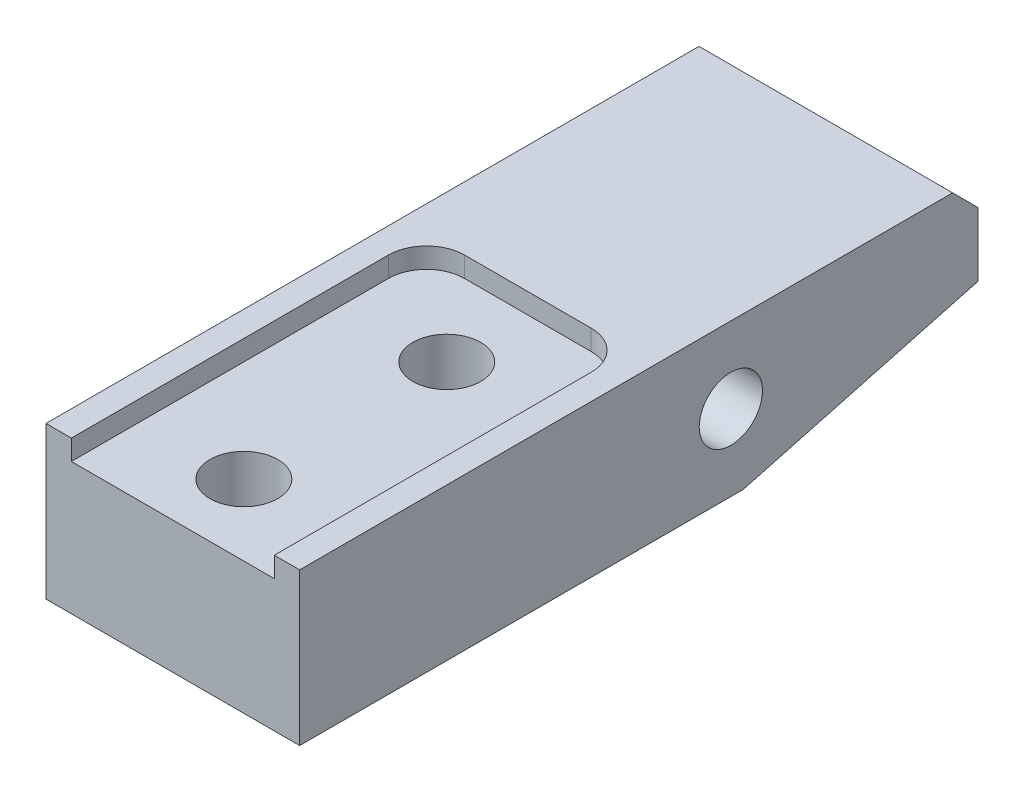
ISO-10303-21;
HEADER;
FILE_DESCRIPTION(('STEP AP214'),'2;1');
FILE_NAME('part.step','',(''),(''),'','','');
FILE_SCHEMA(('AUTOMOTIVE_DESIGN { 1 0 10303 214 1 1 1 1 }'));
ENDSEC;
DATA;
#1=APPLICATION_CONTEXT('core data for automotive mechanical design processes');
#2=APPLICATION_PROTOCOL_DEFINITION('international standard','automotive_design',2000,#1);
#3=PRODUCT_CONTEXT('',#1,'mechanical');
#4=PRODUCT('Part','Part','',(#3));
#5=PRODUCT_RELATED_PRODUCT_CATEGORY('part','',(#4));
#6=PRODUCT_DEFINITION_FORMATION('','',#4);
#7=PRODUCT_DEFINITION_CONTEXT('part definition',#1,'design');
#8=PRODUCT_DEFINITION('design','',#6,#7);
#9=PRODUCT_DEFINITION_SHAPE('','',#8);
#10=(LENGTH_UNIT() NAMED_UNIT(*) SI_UNIT(.MILLI.,.METRE.));
#11=(NAMED_UNIT(*) PLANE_ANGLE_UNIT() SI_UNIT($,.RADIAN.));
#12=(NAMED_UNIT(*) SI_UNIT($,.STERADIAN.) SOLID_ANGLE_UNIT());
#13=UNCERTAINTY_MEASURE_WITH_UNIT(LENGTH_MEASURE(1.E-05),#10,'distance_accuracy_value','');
#14=(GEOMETRIC_REPRESENTATION_CONTEXT(3) GLOBAL_UNCERTAINTY_ASSIGNED_CONTEXT((#13)) GLOBAL_UNIT_ASSIGNED_CONTEXT((#10,
#11,#12)) REPRESENTATION_CONTEXT('',''));
#15=CARTESIAN_POINT('',(0.,0.,0.));
#16=DIRECTION('',(0.,0.,1.));
#17=DIRECTION('',(1.,0.,0.));
#18=AXIS2_PLACEMENT_3D('',#15,#16,#17);
#19=CARTESIAN_POINT('',(-15.875,9.525,-42.4561));
#20=DIRECTION('',(1.,0.,0.));
#21=DIRECTION('',(0.,0.,-1.));
#22=AXIS2_PLACEMENT_3D('',#19,#20,#21);
#23=PLANE('',#22);
#24=CARTESIAN_POINT('',(-15.875,0.,-11.5189));
#25=DIRECTION('',(-1.,0.,0.));
#26=DIRECTION('',(0.,0.,1.));
#27=AXIS2_PLACEMENT_3D('',#24,#25,#26);
#28=CIRCLE('',#27,3.9624);
#29=CARTESIAN_POINT('',(-15.875,0.,-7.5565));
#30=VERTEX_POINT('',#29);
#31=EDGE_CURVE('E137',#30,#30,#28,.T.);
#32=ORIENTED_EDGE('',*,*,#31,.F.);
#33=EDGE_LOOP('',(#32));
#34=FACE_BOUND('',#33,.T.);
#35=DIRECTION('',(0.,0.,1.));
#36=VECTOR('',#35,1.);
#37=CARTESIAN_POINT('',(-15.875,9.525,-42.4561));
#38=LINE('',#37,#36);
#39=CARTESIAN_POINT('',(-15.875,9.525,-39.2811));
#40=VERTEX_POINT('',#39);
#41=CARTESIAN_POINT('',(-15.875,9.525,42.4561));
#42=VERTEX_POINT('',#41);
#43=EDGE_CURVE('E191',#40,#42,#38,.T.);
#44=ORIENTED_EDGE('',*,*,#43,.F.);
#45=DIRECTION('',(0.,-0.707106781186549,-0.707106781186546));
#46=VECTOR('',#45,1.);
#47=CARTESIAN_POINT('',(-15.875,9.525,-39.2811));
#48=LINE('',#47,#46);
#49=CARTESIAN_POINT('',(-15.875,6.34999999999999,-42.4561));
#50=VERTEX_POINT('',#49);
#51=EDGE_CURVE('E57',#40,#50,#48,.T.);
#52=ORIENTED_EDGE('',*,*,#51,.T.);
#53=DIRECTION('',(0.,-1.,0.));
#54=VECTOR('',#53,1.);
#55=CARTESIAN_POINT('',(-15.875,9.525,-42.4561));
#56=LINE('',#55,#54);
#57=CARTESIAN_POINT('',(-15.875,-1.651,-42.4561));
#58=VERTEX_POINT('',#57);
#59=EDGE_CURVE('E128',#50,#58,#56,.T.);
#60=ORIENTED_EDGE('',*,*,#59,.T.);
#61=DIRECTION('',(0.,0.258819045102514,-0.96592582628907));
#62=VECTOR('',#61,1.);
#63=CARTESIAN_POINT('',(-15.875,-9.525,-13.0699319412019));
#64=LINE('',#63,#62);
#65=CARTESIAN_POINT('',(-15.875,-9.525,-13.0699319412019));
#66=VERTEX_POINT('',#65);
#67=EDGE_CURVE('E136',#66,#58,#64,.T.);
#68=ORIENTED_EDGE('',*,*,#67,.F.);
#69=DIRECTION('',(0.,0.,1.));
#70=VECTOR('',#69,1.);
#71=CARTESIAN_POINT('',(-15.875,-9.525,-42.4561));
#72=LINE('',#71,#70);
#73=CARTESIAN_POINT('',(-15.875,-9.525,42.4561));
#74=VERTEX_POINT('',#73);
#75=EDGE_CURVE('E188',#66,#74,#72,.T.);
#76=ORIENTED_EDGE('',*,*,#75,.T.);
#77=DIRECTION('',(0.,-1.,0.));
#78=VECTOR('',#77,1.);
#79=CARTESIAN_POINT('',(-15.875,9.525,42.4561));
#80=LINE('',#79,#78);
#81=EDGE_CURVE('E206',#42,#74,#80,.T.);
#82=ORIENTED_EDGE('',*,*,#81,.F.);
#83=EDGE_LOOP('',(#44,#52,#60,#68,#76,#82));
#84=FACE_BOUND('',#83,.T.);
#85=ADVANCED_FACE('F35',(#34,#84),#23,.F.);
#86=CARTESIAN_POINT('',(-15.875,9.525,42.4561));
#87=DIRECTION('',(0.,0.,-1.));
#88=DIRECTION('',(-1.,0.,0.));
#89=AXIS2_PLACEMENT_3D('',#86,#87,#88);
#90=PLANE('',#89);
#91=DIRECTION('',(1.,0.,0.));
#92=VECTOR('',#91,1.);
#93=CARTESIAN_POINT('',(-15.875,9.525,42.4561));
#94=LINE('',#93,#92);
#95=CARTESIAN_POINT('',(12.7,9.525,42.4561));
#96=VERTEX_POINT('',#95);
#97=CARTESIAN_POINT('',(15.875,9.525,42.4561));
#98=VERTEX_POINT('',#97);
#99=EDGE_CURVE('E193',#96,#98,#94,.T.);
#100=ORIENTED_EDGE('',*,*,#99,.F.);
#101=DIRECTION('',(0.,1.,0.));
#102=VECTOR('',#101,1.);
#103=CARTESIAN_POINT('',(12.7,6.985,42.4561));
#104=LINE('',#103,#102);
#105=CARTESIAN_POINT('',(12.7,6.985,42.4561));
#106=VERTEX_POINT('',#105);
#107=EDGE_CURVE('E186',#106,#96,#104,.T.);
#108=ORIENTED_EDGE('',*,*,#107,.F.);
#109=DIRECTION('',(1.,0.,0.));
#110=VECTOR('',#109,1.);
#111=CARTESIAN_POINT('',(12.7,6.985,42.4561));
#112=LINE('',#111,#110);
#113=CARTESIAN_POINT('',(-12.7,6.985,42.4561));
#114=VERTEX_POINT('',#113);
#115=EDGE_CURVE('E176',#114,#106,#112,.T.);
#116=ORIENTED_EDGE('',*,*,#115,.F.);
#117=DIRECTION('',(0.,1.,0.));
#118=VECTOR('',#117,1.);
#119=CARTESIAN_POINT('',(-12.7,6.985,42.4561));
#120=LINE('',#119,#118);
#121=CARTESIAN_POINT('',(-12.7,9.525,42.4561));
#122=VERTEX_POINT('',#121);
#123=EDGE_CURVE('E179',#114,#122,#120,.T.);
#124=ORIENTED_EDGE('',*,*,#123,.T.);
#125=EDGE_CURVE('E194',#42,#122,#94,.T.);
#126=ORIENTED_EDGE('',*,*,#125,.F.);
#127=ORIENTED_EDGE('',*,*,#81,.T.);
#128=DIRECTION('',(1.,0.,0.));
#129=VECTOR('',#128,1.);
#130=CARTESIAN_POINT('',(-15.875,-9.525,42.4561));
#131=LINE('',#130,#129);
#132=CARTESIAN_POINT('',(15.875,-9.525,42.4561));
#133=VERTEX_POINT('',#132);
#134=EDGE_CURVE('E201',#74,#133,#131,.T.);
#135=ORIENTED_EDGE('',*,*,#134,.T.);
#136=DIRECTION('',(0.,-1.,0.));
#137=VECTOR('',#136,1.);
#138=CARTESIAN_POINT('',(15.875,9.525,42.4561));
#139=LINE('',#138,#137);
#140=EDGE_CURVE('E127',#98,#133,#139,.T.);
#141=ORIENTED_EDGE('',*,*,#140,.F.);
#142=EDGE_LOOP('',(#100,#108,#116,#124,#126,#127,#135,#141));
#143=FACE_BOUND('',#142,.T.);
#144=ADVANCED_FACE('F241',(#143),#90,.F.);
#145=CARTESIAN_POINT('',(15.875,9.525,-42.4561));
#146=DIRECTION('',(-1.,0.,0.));
#147=DIRECTION('',(0.,0.,1.));
#148=AXIS2_PLACEMENT_3D('',#145,#146,#147);
#149=PLANE('',#148);
#150=CARTESIAN_POINT('',(15.875,0.,-11.5189));
#151=DIRECTION('',(-1.,0.,0.));
#152=DIRECTION('',(0.,0.,1.));
#153=AXIS2_PLACEMENT_3D('',#150,#151,#152);
#154=CIRCLE('',#153,3.9624);
#155=CARTESIAN_POINT('',(15.875,0.,-7.5565));
#156=VERTEX_POINT('',#155);
#157=EDGE_CURVE('E149',#156,#156,#154,.T.);
#158=ORIENTED_EDGE('',*,*,#157,.T.);
#159=EDGE_LOOP('',(#158));
#160=FACE_BOUND('',#159,.T.);
#161=DIRECTION('',(0.,-1.,0.));
#162=VECTOR('',#161,1.);
#163=CARTESIAN_POINT('',(15.875,9.525,-42.4561));
#164=LINE('',#163,#162);
#165=CARTESIAN_POINT('',(15.875,6.34999999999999,-42.4561));
#166=VERTEX_POINT('',#165);
#167=CARTESIAN_POINT('',(15.875,-1.651,-42.4561));
#168=VERTEX_POINT('',#167);
#169=EDGE_CURVE('E120',#166,#168,#164,.T.);
#170=ORIENTED_EDGE('',*,*,#169,.F.);
#171=DIRECTION('',(0.,0.707106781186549,0.707106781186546));
#172=VECTOR('',#171,1.);
#173=CARTESIAN_POINT('',(15.875,9.525,-39.2811));
#174=LINE('',#173,#172);
#175=CARTESIAN_POINT('',(15.875,9.525,-39.2811));
#176=VERTEX_POINT('',#175);
#177=EDGE_CURVE('E11',#166,#176,#174,.T.);
#178=ORIENTED_EDGE('',*,*,#177,.T.);
#179=DIRECTION('',(0.,0.,-1.));
#180=VECTOR('',#179,1.);
#181=CARTESIAN_POINT('',(15.875,9.525,-42.4561));
#182=LINE('',#181,#180);
#183=EDGE_CURVE('E197',#98,#176,#182,.T.);
#184=ORIENTED_EDGE('',*,*,#183,.F.);
#185=ORIENTED_EDGE('',*,*,#140,.T.);
#186=DIRECTION('',(0.,0.,-1.));
#187=VECTOR('',#186,1.);
#188=CARTESIAN_POINT('',(15.875,-9.525,-42.4561));
#189=LINE('',#188,#187);
#190=CARTESIAN_POINT('',(15.875,-9.525,-13.0699319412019));
#191=VERTEX_POINT('',#190);
#192=EDGE_CURVE('E144',#133,#191,#189,.T.);
#193=ORIENTED_EDGE('',*,*,#192,.T.);
#194=DIRECTION('',(0.,0.258819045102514,-0.96592582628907));
#195=VECTOR('',#194,1.);
#196=CARTESIAN_POINT('',(15.875,-9.525,-13.0699319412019));
#197=LINE('',#196,#195);
#198=EDGE_CURVE('E133',#191,#168,#197,.T.);
#199=ORIENTED_EDGE('',*,*,#198,.T.);
#200=EDGE_LOOP('',(#170,#178,#184,#185,#193,#199));
#201=FACE_BOUND('',#200,.T.);
#202=ADVANCED_FACE('F141',(#160,#201),#149,.F.);
#203=CARTESIAN_POINT('',(-15.875,9.525,-42.4561));
#204=DIRECTION('',(0.,0.,1.));
#205=DIRECTION('',(1.,0.,0.));
#206=AXIS2_PLACEMENT_3D('',#203,#204,#205);
#207=PLANE('',#206);
#208=ORIENTED_EDGE('',*,*,#59,.F.);
#209=DIRECTION('',(1.,0.,0.));
#210=VECTOR('',#209,1.);
#211=CARTESIAN_POINT('',(15.875,6.34999999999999,-42.4561));
#212=LINE('',#211,#210);
#213=EDGE_CURVE('E43',#50,#166,#212,.T.);
#214=ORIENTED_EDGE('',*,*,#213,.T.);
#215=ORIENTED_EDGE('',*,*,#169,.T.);
#216=DIRECTION('',(-1.,0.,0.));
#217=VECTOR('',#216,1.);
#218=CARTESIAN_POINT('',(15.875,-1.651,-42.4561));
#219=LINE('',#218,#217);
#220=EDGE_CURVE('E123',#168,#58,#219,.T.);
#221=ORIENTED_EDGE('',*,*,#220,.T.);
#222=EDGE_LOOP('',(#208,#214,#215,#221));
#223=FACE_BOUND('',#222,.T.);
#224=ADVANCED_FACE('F122',(#223),#207,.F.);
#225=CARTESIAN_POINT('',(-15.875,9.525,42.4561));
#226=DIRECTION('',(0.,1.,0.));
#227=DIRECTION('',(0.,0.,1.));
#228=AXIS2_PLACEMENT_3D('',#225,#226,#227);
#229=PLANE('',#228);
#230=ORIENTED_EDGE('',*,*,#183,.T.);
#231=DIRECTION('',(-1.,0.,0.));
#232=VECTOR('',#231,1.);
#233=CARTESIAN_POINT('',(-15.875,9.525,-39.2811));
#234=LINE('',#233,#232);
#235=EDGE_CURVE('E227',#176,#40,#234,.T.);
#236=ORIENTED_EDGE('',*,*,#235,.T.);
#237=ORIENTED_EDGE('',*,*,#43,.T.);
#238=ORIENTED_EDGE('',*,*,#125,.T.);
#239=DIRECTION('',(0.,0.,1.));
#240=VECTOR('',#239,1.);
#241=CARTESIAN_POINT('',(-12.7,9.525,42.4561));
#242=LINE('',#241,#240);
#243=CARTESIAN_POINT('',(-12.7,9.525,2.7813));
#244=VERTEX_POINT('',#243);
#245=EDGE_CURVE('E171',#244,#122,#242,.T.);
#246=ORIENTED_EDGE('',*,*,#245,.F.);
#247=CARTESIAN_POINT('',(-7.9248,9.525,2.7813));
#248=DIRECTION('',(0.,1.,0.));
#249=DIRECTION('',(0.,0.,1.));
#250=AXIS2_PLACEMENT_3D('',#247,#248,#249);
#251=CIRCLE('',#250,4.7752);
#252=CARTESIAN_POINT('',(-7.9248,9.525,-1.9939));
#253=VERTEX_POINT('',#252);
#254=EDGE_CURVE('E225',#244,#253,#251,.F.);
#255=ORIENTED_EDGE('',*,*,#254,.T.);
#256=DIRECTION('',(-1.,0.,0.));
#257=VECTOR('',#256,1.);
#258=CARTESIAN_POINT('',(12.7,9.525,-1.9939));
#259=LINE('',#258,#257);
#260=CARTESIAN_POINT('',(7.9248,9.525,-1.9939));
#261=VERTEX_POINT('',#260);
#262=EDGE_CURVE('E182',#261,#253,#259,.T.);
#263=ORIENTED_EDGE('',*,*,#262,.F.);
#264=CARTESIAN_POINT('',(7.9248,9.525,2.7813));
#265=DIRECTION('',(0.,1.,0.));
#266=DIRECTION('',(0.,0.,1.));
#267=AXIS2_PLACEMENT_3D('',#264,#265,#266);
#268=CIRCLE('',#267,4.7752);
#269=CARTESIAN_POINT('',(12.7,9.525,2.7813));
#270=VERTEX_POINT('',#269);
#271=EDGE_CURVE('E223',#261,#270,#268,.F.);
#272=ORIENTED_EDGE('',*,*,#271,.T.);
#273=DIRECTION('',(0.,0.,-1.));
#274=VECTOR('',#273,1.);
#275=CARTESIAN_POINT('',(12.7,9.525,42.4561));
#276=LINE('',#275,#274);
#277=EDGE_CURVE('E166',#96,#270,#276,.T.);
#278=ORIENTED_EDGE('',*,*,#277,.F.);
#279=ORIENTED_EDGE('',*,*,#99,.T.);
#280=EDGE_LOOP('',(#230,#236,#237,#238,#246,#255,#263,#272,#278,#279));
#281=FACE_BOUND('',#280,.T.);
#282=ADVANCED_FACE('F232',(#281),#229,.T.);
#283=CARTESIAN_POINT('',(-15.875,-9.525,42.4561));
#284=DIRECTION('',(0.,1.,0.));
#285=DIRECTION('',(0.,0.,1.));
#286=AXIS2_PLACEMENT_3D('',#283,#284,#285);
#287=PLANE('',#286);
#288=CARTESIAN_POINT('',(0.,-9.525,8.1661));
#289=DIRECTION('',(0.,1.,0.));
#290=DIRECTION('',(0.,0.,1.));
#291=AXIS2_PLACEMENT_3D('',#288,#289,#290);
#292=CIRCLE('',#291,4.25);
#293=CARTESIAN_POINT('',(0.,-9.525,12.4161));
#294=VERTEX_POINT('',#293);
#295=EDGE_CURVE('E152',#294,#294,#292,.T.);
#296=ORIENTED_EDGE('',*,*,#295,.T.);
#297=EDGE_LOOP('',(#296));
#298=FACE_BOUND('',#297,.T.);
#299=CARTESIAN_POINT('',(0.,-9.525,33.5661));
#300=DIRECTION('',(0.,1.,0.));
#301=DIRECTION('',(0.,0.,1.));
#302=AXIS2_PLACEMENT_3D('',#299,#300,#301);
#303=CIRCLE('',#302,4.25);
#304=CARTESIAN_POINT('',(0.,-9.525,37.8161));
#305=VERTEX_POINT('',#304);
#306=EDGE_CURVE('E160',#305,#305,#303,.T.);
#307=ORIENTED_EDGE('',*,*,#306,.T.);
#308=EDGE_LOOP('',(#307));
#309=FACE_BOUND('',#308,.T.);
#310=ORIENTED_EDGE('',*,*,#75,.F.);
#311=DIRECTION('',(-1.,0.,0.));
#312=VECTOR('',#311,1.);
#313=CARTESIAN_POINT('',(15.875,-9.525,-13.0699319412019));
#314=LINE('',#313,#312);
#315=EDGE_CURVE('E138',#191,#66,#314,.T.);
#316=ORIENTED_EDGE('',*,*,#315,.F.);
#317=ORIENTED_EDGE('',*,*,#192,.F.);
#318=ORIENTED_EDGE('',*,*,#134,.F.);
#319=EDGE_LOOP('',(#310,#316,#317,#318));
#320=FACE_BOUND('',#319,.T.);
#321=ADVANCED_FACE('F312',(#298,#309,#320),#287,.F.);
#322=CARTESIAN_POINT('',(12.7,6.985,42.4561));
#323=DIRECTION('',(1.,0.,0.));
#324=DIRECTION('',(0.,0.,-1.));
#325=AXIS2_PLACEMENT_3D('',#322,#323,#324);
#326=PLANE('',#325);
#327=ORIENTED_EDGE('',*,*,#277,.T.);
#328=DIRECTION('',(0.,1.,0.));
#329=VECTOR('',#328,1.);
#330=CARTESIAN_POINT('',(12.7,6.985,2.7813));
#331=LINE('',#330,#329);
#332=CARTESIAN_POINT('',(12.7,6.985,2.7813));
#333=VERTEX_POINT('',#332);
#334=EDGE_CURVE('E214',#270,#333,#331,.F.);
#335=ORIENTED_EDGE('',*,*,#334,.T.);
#336=DIRECTION('',(0.,0.,-1.));
#337=VECTOR('',#336,1.);
#338=CARTESIAN_POINT('',(12.7,6.985,42.4561));
#339=LINE('',#338,#337);
#340=EDGE_CURVE('E167',#106,#333,#339,.T.);
#341=ORIENTED_EDGE('',*,*,#340,.F.);
#342=ORIENTED_EDGE('',*,*,#107,.T.);
#343=EDGE_LOOP('',(#327,#335,#341,#342));
#344=FACE_BOUND('',#343,.T.);
#345=ADVANCED_FACE('F267',(#344),#326,.F.);
#346=CARTESIAN_POINT('',(-12.7,6.985,42.4561));
#347=DIRECTION('',(-1.,0.,0.));
#348=DIRECTION('',(0.,0.,1.));
#349=AXIS2_PLACEMENT_3D('',#346,#347,#348);
#350=PLANE('',#349);
#351=DIRECTION('',(0.,0.,1.));
#352=VECTOR('',#351,1.);
#353=CARTESIAN_POINT('',(-12.7,6.985,42.4561));
#354=LINE('',#353,#352);
#355=CARTESIAN_POINT('',(-12.7,6.985,2.7813));
#356=VERTEX_POINT('',#355);
#357=EDGE_CURVE('E174',#356,#114,#354,.T.);
#358=ORIENTED_EDGE('',*,*,#357,.F.);
#359=DIRECTION('',(0.,1.,0.));
#360=VECTOR('',#359,1.);
#361=CARTESIAN_POINT('',(-12.7,9.525,2.7813));
#362=LINE('',#361,#360);
#363=EDGE_CURVE('E220',#356,#244,#362,.T.);
#364=ORIENTED_EDGE('',*,*,#363,.T.);
#365=ORIENTED_EDGE('',*,*,#245,.T.);
#366=ORIENTED_EDGE('',*,*,#123,.F.);
#367=EDGE_LOOP('',(#358,#364,#365,#366));
#368=FACE_BOUND('',#367,.T.);
#369=ADVANCED_FACE('F249',(#368),#350,.F.);
#370=CARTESIAN_POINT('',(12.7,6.985,-1.9939));
#371=DIRECTION('',(0.,0.,-1.));
#372=DIRECTION('',(-1.,0.,0.));
#373=AXIS2_PLACEMENT_3D('',#370,#371,#372);
#374=PLANE('',#373);
#375=DIRECTION('',(-1.,0.,0.));
#376=VECTOR('',#375,1.);
#377=CARTESIAN_POINT('',(12.7,6.985,-1.9939));
#378=LINE('',#377,#376);
#379=CARTESIAN_POINT('',(7.9248,6.985,-1.9939));
#380=VERTEX_POINT('',#379);
#381=CARTESIAN_POINT('',(-7.9248,6.985,-1.9939));
#382=VERTEX_POINT('',#381);
#383=EDGE_CURVE('E170',#380,#382,#378,.T.);
#384=ORIENTED_EDGE('',*,*,#383,.F.);
#385=DIRECTION('',(0.,1.,0.));
#386=VECTOR('',#385,1.);
#387=CARTESIAN_POINT('',(7.9248,9.525,-1.9939));
#388=LINE('',#387,#386);
#389=EDGE_CURVE('E211',#380,#261,#388,.T.);
#390=ORIENTED_EDGE('',*,*,#389,.T.);
#391=ORIENTED_EDGE('',*,*,#262,.T.);
#392=DIRECTION('',(0.,1.,0.));
#393=VECTOR('',#392,1.);
#394=CARTESIAN_POINT('',(-7.9248,6.985,-1.9939));
#395=LINE('',#394,#393);
#396=EDGE_CURVE('E209',#253,#382,#395,.F.);
#397=ORIENTED_EDGE('',*,*,#396,.T.);
#398=EDGE_LOOP('',(#384,#390,#391,#397));
#399=FACE_BOUND('',#398,.T.);
#400=ADVANCED_FACE('F257',(#399),#374,.F.);
#401=CARTESIAN_POINT('',(12.7,6.985,-1.9939));
#402=DIRECTION('',(0.,1.,0.));
#403=DIRECTION('',(0.,0.,1.));
#404=AXIS2_PLACEMENT_3D('',#401,#402,#403);
#405=PLANE('',#404);
#406=CARTESIAN_POINT('',(0.,6.985,8.1661));
#407=DIRECTION('',(0.,1.,0.));
#408=DIRECTION('',(0.,0.,1.));
#409=AXIS2_PLACEMENT_3D('',#406,#407,#408);
#410=CIRCLE('',#409,4.25);
#411=CARTESIAN_POINT('',(0.,6.985,12.4161));
#412=VERTEX_POINT('',#411);
#413=EDGE_CURVE('E157',#412,#412,#410,.T.);
#414=ORIENTED_EDGE('',*,*,#413,.F.);
#415=EDGE_LOOP('',(#414));
#416=FACE_BOUND('',#415,.T.);
#417=CARTESIAN_POINT('',(0.,6.985,33.5661));
#418=DIRECTION('',(0.,1.,0.));
#419=DIRECTION('',(0.,0.,1.));
#420=AXIS2_PLACEMENT_3D('',#417,#418,#419);
#421=CIRCLE('',#420,4.25);
#422=CARTESIAN_POINT('',(0.,6.985,37.8161));
#423=VERTEX_POINT('',#422);
#424=EDGE_CURVE('E163',#423,#423,#421,.T.);
#425=ORIENTED_EDGE('',*,*,#424,.F.);
#426=EDGE_LOOP('',(#425));
#427=FACE_BOUND('',#426,.T.);
#428=ORIENTED_EDGE('',*,*,#340,.T.);
#429=CARTESIAN_POINT('',(7.9248,6.985,2.7813));
#430=DIRECTION('',(0.,1.,0.));
#431=DIRECTION('',(0.,0.,1.));
#432=AXIS2_PLACEMENT_3D('',#429,#430,#431);
#433=CIRCLE('',#432,4.7752);
#434=EDGE_CURVE('E218',#333,#380,#433,.T.);
#435=ORIENTED_EDGE('',*,*,#434,.T.);
#436=ORIENTED_EDGE('',*,*,#383,.T.);
#437=CARTESIAN_POINT('',(-7.9248,6.985,2.7813));
#438=DIRECTION('',(0.,1.,0.));
#439=DIRECTION('',(0.,0.,1.));
#440=AXIS2_PLACEMENT_3D('',#437,#438,#439);
#441=CIRCLE('',#440,4.7752);
#442=EDGE_CURVE('E216',#382,#356,#441,.T.);
#443=ORIENTED_EDGE('',*,*,#442,.T.);
#444=ORIENTED_EDGE('',*,*,#357,.T.);
#445=ORIENTED_EDGE('',*,*,#115,.T.);
#446=EDGE_LOOP('',(#428,#435,#436,#443,#444,#445));
#447=FACE_BOUND('',#446,.T.);
#448=ADVANCED_FACE('F260',(#416,#427,#447),#405,.T.);
#449=CARTESIAN_POINT('',(7.9248,6.985,2.7813));
#450=DIRECTION('',(0.,-1.,0.));
#451=DIRECTION('',(0.,0.,-1.));
#452=AXIS2_PLACEMENT_3D('',#449,#450,#451);
#453=CYLINDRICAL_SURFACE('',#452,4.7752);
#454=ORIENTED_EDGE('',*,*,#434,.F.);
#455=ORIENTED_EDGE('',*,*,#334,.F.);
#456=ORIENTED_EDGE('',*,*,#271,.F.);
#457=ORIENTED_EDGE('',*,*,#389,.F.);
#458=EDGE_LOOP('',(#454,#455,#456,#457));
#459=FACE_BOUND('',#458,.T.);
#460=ADVANCED_FACE('F264',(#459),#453,.F.);
#461=CARTESIAN_POINT('',(-7.9248,6.985,2.7813));
#462=DIRECTION('',(0.,-1.,0.));
#463=DIRECTION('',(0.,0.,-1.));
#464=AXIS2_PLACEMENT_3D('',#461,#462,#463);
#465=CYLINDRICAL_SURFACE('',#464,4.7752);
#466=ORIENTED_EDGE('',*,*,#442,.F.);
#467=ORIENTED_EDGE('',*,*,#396,.F.);
#468=ORIENTED_EDGE('',*,*,#254,.F.);
#469=ORIENTED_EDGE('',*,*,#363,.F.);
#470=EDGE_LOOP('',(#466,#467,#468,#469));
#471=FACE_BOUND('',#470,.T.);
#472=ADVANCED_FACE('F253',(#471),#465,.F.);
#473=CARTESIAN_POINT('',(0.,6.985,33.5661));
#474=DIRECTION('',(0.,1.,0.));
#475=DIRECTION('',(0.,0.,1.));
#476=AXIS2_PLACEMENT_3D('',#473,#474,#475);
#477=CYLINDRICAL_SURFACE('',#476,4.25);
#478=ORIENTED_EDGE('',*,*,#306,.F.);
#479=EDGE_LOOP('',(#478));
#480=FACE_BOUND('',#479,.T.);
#481=ORIENTED_EDGE('',*,*,#424,.T.);
#482=EDGE_LOOP('',(#481));
#483=FACE_BOUND('',#482,.T.);
#484=ADVANCED_FACE('F287',(#480,#483),#477,.F.);
#485=CARTESIAN_POINT('',(0.,6.985,8.1661));
#486=DIRECTION('',(0.,1.,0.));
#487=DIRECTION('',(0.,0.,1.));
#488=AXIS2_PLACEMENT_3D('',#485,#486,#487);
#489=CYLINDRICAL_SURFACE('',#488,4.25);
#490=ORIENTED_EDGE('',*,*,#295,.F.);
#491=EDGE_LOOP('',(#490));
#492=FACE_BOUND('',#491,.T.);
#493=ORIENTED_EDGE('',*,*,#413,.T.);
#494=EDGE_LOOP('',(#493));
#495=FACE_BOUND('',#494,.T.);
#496=ADVANCED_FACE('F291',(#492,#495),#489,.F.);
#497=CARTESIAN_POINT('',(15.875,0.,-11.5189));
#498=DIRECTION('',(-1.,0.,0.));
#499=DIRECTION('',(0.,0.,1.));
#500=AXIS2_PLACEMENT_3D('',#497,#498,#499);
#501=CYLINDRICAL_SURFACE('',#500,3.9624);
#502=ORIENTED_EDGE('',*,*,#157,.F.);
#503=EDGE_LOOP('',(#502));
#504=FACE_BOUND('',#503,.T.);
#505=ORIENTED_EDGE('',*,*,#31,.T.);
#506=EDGE_LOOP('',(#505));
#507=FACE_BOUND('',#506,.T.);
#508=ADVANCED_FACE('F273',(#504,#507),#501,.F.);
#509=CARTESIAN_POINT('',(15.875,-9.525,-13.0699319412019));
#510=DIRECTION('',(0.,0.96592582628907,0.258819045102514));
#511=DIRECTION('',(0.,-0.258819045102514,0.96592582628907));
#512=AXIS2_PLACEMENT_3D('',#509,#510,#511);
#513=PLANE('',#512);
#514=ORIENTED_EDGE('',*,*,#67,.T.);
#515=ORIENTED_EDGE('',*,*,#220,.F.);
#516=ORIENTED_EDGE('',*,*,#198,.F.);
#517=ORIENTED_EDGE('',*,*,#315,.T.);
#518=EDGE_LOOP('',(#514,#515,#516,#517));
#519=FACE_BOUND('',#518,.T.);
#520=ADVANCED_FACE('F132',(#519),#513,.F.);
#521=CARTESIAN_POINT('',(-15.875,9.525,-39.2811));
#522=DIRECTION('',(0.,0.707106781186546,-0.707106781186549));
#523=DIRECTION('',(0.,0.707106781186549,0.707106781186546));
#524=AXIS2_PLACEMENT_3D('',#521,#522,#523);
#525=PLANE('',#524);
#526=ORIENTED_EDGE('',*,*,#177,.F.);
#527=ORIENTED_EDGE('',*,*,#213,.F.);
#528=ORIENTED_EDGE('',*,*,#51,.F.);
#529=ORIENTED_EDGE('',*,*,#235,.F.);
#530=EDGE_LOOP('',(#526,#527,#528,#529));
#531=FACE_BOUND('',#530,.T.);
#532=ADVANCED_FACE('F37',(#531),#525,.T.);
#533=CLOSED_SHELL('',(#85,#144,#202,#224,#282,#321,#345,#369,#400,#448,#460,#472,#484,#496,#508,
#520,#532));
#534=MANIFOLD_SOLID_BREP('B2',#533);
#535=ADVANCED_BREP_SHAPE_REPRESENTATION('',(#18,#534),#14);
#536=SHAPE_DEFINITION_REPRESENTATION(#9,#535);
ENDSEC;
END-ISO-10303-21;
